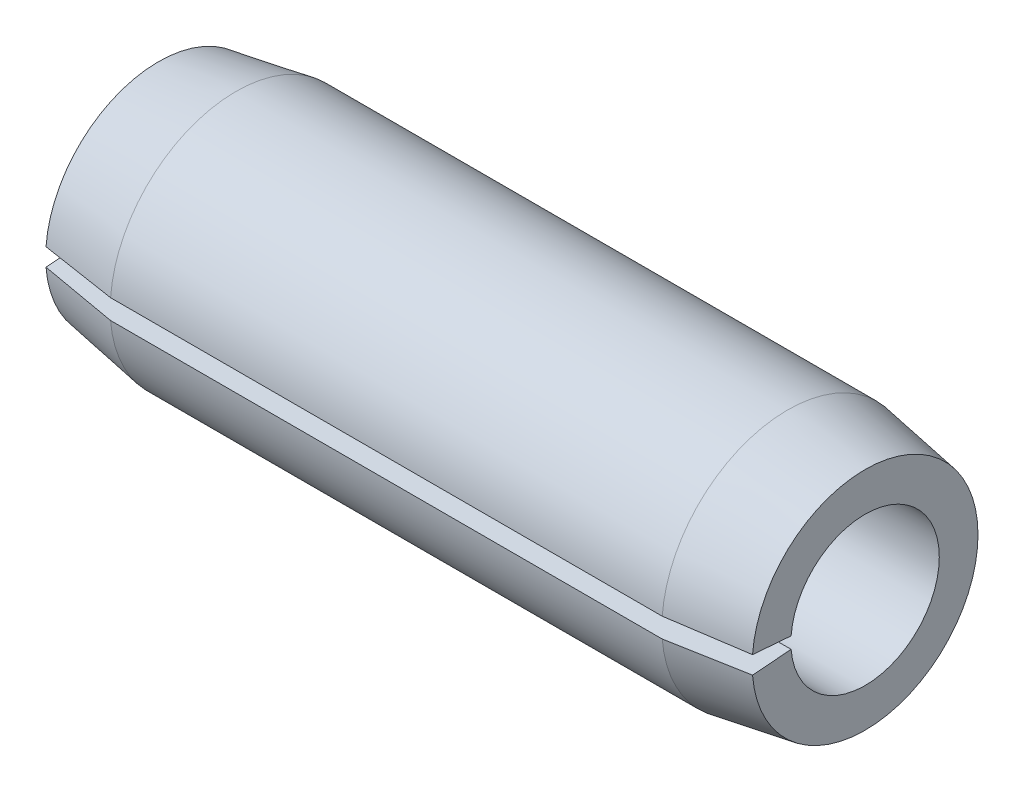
ISO-10303-21;
HEADER;
FILE_DESCRIPTION(('STEP AP214'),'2;1');
FILE_NAME('part.step','',(''),(''),'','','');
FILE_SCHEMA(('AUTOMOTIVE_DESIGN { 1 0 10303 214 1 1 1 1 }'));
ENDSEC;
DATA;
#1=APPLICATION_CONTEXT('core data for automotive mechanical design processes');
#2=APPLICATION_PROTOCOL_DEFINITION('international standard','automotive_design',2000,#1);
#3=PRODUCT_CONTEXT('',#1,'mechanical');
#4=PRODUCT('Part','Part','',(#3));
#5=PRODUCT_RELATED_PRODUCT_CATEGORY('part','',(#4));
#6=PRODUCT_DEFINITION_FORMATION('','',#4);
#7=PRODUCT_DEFINITION_CONTEXT('part definition',#1,'design');
#8=PRODUCT_DEFINITION('design','',#6,#7);
#9=PRODUCT_DEFINITION_SHAPE('','',#8);
#10=(LENGTH_UNIT() NAMED_UNIT(*) SI_UNIT(.MILLI.,.METRE.));
#11=(NAMED_UNIT(*) PLANE_ANGLE_UNIT() SI_UNIT($,.RADIAN.));
#12=(NAMED_UNIT(*) SI_UNIT($,.STERADIAN.) SOLID_ANGLE_UNIT());
#13=UNCERTAINTY_MEASURE_WITH_UNIT(LENGTH_MEASURE(1.E-05),#10,'distance_accuracy_value','');
#14=(GEOMETRIC_REPRESENTATION_CONTEXT(3) GLOBAL_UNCERTAINTY_ASSIGNED_CONTEXT((#13)) GLOBAL_UNIT_ASSIGNED_CONTEXT((#10,
#11,#12)) REPRESENTATION_CONTEXT('',''));
#15=CARTESIAN_POINT('',(0.,0.,0.));
#16=DIRECTION('',(0.,0.,1.));
#17=DIRECTION('',(1.,0.,0.));
#18=AXIS2_PLACEMENT_3D('',#15,#16,#17);
#19=CARTESIAN_POINT('',(0.,1.778,0.));
#20=DIRECTION('',(1.,0.,0.));
#21=DIRECTION('',(0.,0.,-1.));
#22=AXIS2_PLACEMENT_3D('',#19,#20,#21);
#23=PLANE('',#22);
#24=DIRECTION('',(0.,0.0784590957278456,0.996917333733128));
#25=VECTOR('',#24,1.);
#26=CARTESIAN_POINT('',(0.,0.,0.));
#27=LINE('',#26,#25);
#28=CARTESIAN_POINT('',(0.,0.0916716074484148,1.16479821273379));
#29=VERTEX_POINT('',#28);
#30=CARTESIAN_POINT('',(0.,0.139500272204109,1.7725190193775));
#31=VERTEX_POINT('',#30);
#32=EDGE_CURVE('E82',#29,#31,#27,.T.);
#33=ORIENTED_EDGE('',*,*,#32,.T.);
#34=CARTESIAN_POINT('',(0.,0.,0.));
#35=DIRECTION('',(-1.,0.,0.));
#36=DIRECTION('',(0.,0.,1.));
#37=AXIS2_PLACEMENT_3D('',#34,#35,#36);
#38=CIRCLE('',#37,1.778);
#39=CARTESIAN_POINT('',(0.,-0.13950027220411,1.7725190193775));
#40=VERTEX_POINT('',#39);
#41=EDGE_CURVE('E100',#31,#40,#38,.T.);
#42=ORIENTED_EDGE('',*,*,#41,.T.);
#43=DIRECTION('',(0.,-0.0784590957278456,0.996917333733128));
#44=VECTOR('',#43,1.);
#45=CARTESIAN_POINT('',(0.,0.,0.));
#46=LINE('',#45,#44);
#47=CARTESIAN_POINT('',(0.,-0.0916716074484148,1.16479821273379));
#48=VERTEX_POINT('',#47);
#49=EDGE_CURVE('E54',#48,#40,#46,.T.);
#50=ORIENTED_EDGE('',*,*,#49,.F.);
#51=CARTESIAN_POINT('',(0.,0.,0.));
#52=DIRECTION('',(-1.,0.,0.));
#53=DIRECTION('',(0.,0.,1.));
#54=AXIS2_PLACEMENT_3D('',#51,#52,#53);
#55=CIRCLE('',#54,1.1684);
#56=EDGE_CURVE('E97',#29,#48,#55,.T.);
#57=ORIENTED_EDGE('',*,*,#56,.F.);
#58=EDGE_LOOP('',(#33,#42,#50,#57));
#59=FACE_BOUND('',#58,.T.);
#60=ADVANCED_FACE('F33',(#59),#23,.F.);
#61=CARTESIAN_POINT('',(-9.52499999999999,0.,0.));
#62=DIRECTION('',(-1.,0.,0.));
#63=DIRECTION('',(0.,0.,1.));
#64=AXIS2_PLACEMENT_3D('',#61,#62,#63);
#65=CYLINDRICAL_SURFACE('',#64,1.1684);
#66=DIRECTION('',(-1.,0.,0.));
#67=VECTOR('',#66,1.);
#68=CARTESIAN_POINT('',(-9.52499999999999,0.0916716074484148,1.16479821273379));
#69=LINE('',#68,#67);
#70=CARTESIAN_POINT('',(11.1252,0.0916716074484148,1.16479821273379));
#71=VERTEX_POINT('',#70);
#72=EDGE_CURVE('E85',#29,#71,#69,.F.);
#73=ORIENTED_EDGE('',*,*,#72,.F.);
#74=ORIENTED_EDGE('',*,*,#56,.T.);
#75=DIRECTION('',(-1.,0.,0.));
#76=VECTOR('',#75,1.);
#77=CARTESIAN_POINT('',(-9.52499999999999,-0.0916716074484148,1.16479821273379));
#78=LINE('',#77,#76);
#79=CARTESIAN_POINT('',(11.1252,-0.0916716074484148,1.16479821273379));
#80=VERTEX_POINT('',#79);
#81=EDGE_CURVE('E118',#48,#80,#78,.F.);
#82=ORIENTED_EDGE('',*,*,#81,.T.);
#83=CARTESIAN_POINT('',(11.1252,0.,0.));
#84=DIRECTION('',(-1.,0.,0.));
#85=DIRECTION('',(0.,0.,1.));
#86=AXIS2_PLACEMENT_3D('',#83,#84,#85);
#87=CIRCLE('',#86,1.1684);
#88=EDGE_CURVE('E99',#71,#80,#87,.T.);
#89=ORIENTED_EDGE('',*,*,#88,.F.);
#90=EDGE_LOOP('',(#73,#74,#82,#89));
#91=FACE_BOUND('',#90,.T.);
#92=ADVANCED_FACE('F95',(#91),#65,.F.);
#93=CARTESIAN_POINT('',(11.1252,1.1684,0.));
#94=DIRECTION('',(-1.,0.,0.));
#95=DIRECTION('',(0.,0.,1.));
#96=AXIS2_PLACEMENT_3D('',#93,#94,#95);
#97=PLANE('',#96);
#98=DIRECTION('',(0.,0.0784590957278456,0.996917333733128));
#99=VECTOR('',#98,1.);
#100=CARTESIAN_POINT('',(11.1252,0.,0.));
#101=LINE('',#100,#99);
#102=CARTESIAN_POINT('',(11.1252,0.139500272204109,1.7725190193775));
#103=VERTEX_POINT('',#102);
#104=EDGE_CURVE('E127',#71,#103,#101,.T.);
#105=ORIENTED_EDGE('',*,*,#104,.F.);
#106=ORIENTED_EDGE('',*,*,#88,.T.);
#107=DIRECTION('',(0.,-0.0784590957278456,0.996917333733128));
#108=VECTOR('',#107,1.);
#109=CARTESIAN_POINT('',(11.1252,0.,0.));
#110=LINE('',#109,#108);
#111=CARTESIAN_POINT('',(11.1252,-0.139500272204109,1.7725190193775));
#112=VERTEX_POINT('',#111);
#113=EDGE_CURVE('E126',#80,#112,#110,.T.);
#114=ORIENTED_EDGE('',*,*,#113,.T.);
#115=CARTESIAN_POINT('',(11.1252,0.,0.));
#116=DIRECTION('',(-1.,0.,0.));
#117=DIRECTION('',(0.,0.,1.));
#118=AXIS2_PLACEMENT_3D('',#115,#116,#117);
#119=CIRCLE('',#118,1.778);
#120=EDGE_CURVE('E104',#103,#112,#119,.T.);
#121=ORIENTED_EDGE('',*,*,#120,.F.);
#122=EDGE_LOOP('',(#105,#106,#114,#121));
#123=FACE_BOUND('',#122,.T.);
#124=ADVANCED_FACE('F137',(#123),#97,.F.);
#125=CARTESIAN_POINT('',(11.1252,0.,0.));
#126=DIRECTION('',(-1.,0.,0.));
#127=DIRECTION('',(0.,0.,1.));
#128=AXIS2_PLACEMENT_3D('',#125,#126,#127);
#129=CONICAL_SURFACE('',#128,1.778,0.165148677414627);
#130=DIRECTION('',(-0.986393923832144,0.0128985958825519,0.163892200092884));
#131=VECTOR('',#130,1.);
#132=CARTESIAN_POINT('',(21.7932,0.,0.));
#133=LINE('',#132,#131);
#134=CARTESIAN_POINT('',(9.906,0.155443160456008,1.97509262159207));
#135=VERTEX_POINT('',#134);
#136=EDGE_CURVE('E101',#103,#135,#133,.T.);
#137=ORIENTED_EDGE('',*,*,#136,.F.);
#138=ORIENTED_EDGE('',*,*,#120,.T.);
#139=DIRECTION('',(-0.986393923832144,-0.0128985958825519,0.163892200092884));
#140=VECTOR('',#139,1.);
#141=CARTESIAN_POINT('',(21.7932,0.,0.));
#142=LINE('',#141,#140);
#143=CARTESIAN_POINT('',(9.906,-0.155443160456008,1.97509262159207));
#144=VERTEX_POINT('',#143);
#145=EDGE_CURVE('E120',#112,#144,#142,.T.);
#146=ORIENTED_EDGE('',*,*,#145,.T.);
#147=CARTESIAN_POINT('',(9.906,0.,0.));
#148=DIRECTION('',(-1.,0.,0.));
#149=DIRECTION('',(0.,0.,1.));
#150=AXIS2_PLACEMENT_3D('',#147,#148,#149);
#151=CIRCLE('',#150,1.9812);
#152=EDGE_CURVE('E109',#135,#144,#151,.T.);
#153=ORIENTED_EDGE('',*,*,#152,.F.);
#154=EDGE_LOOP('',(#137,#138,#146,#153));
#155=FACE_BOUND('',#154,.T.);
#156=ADVANCED_FACE('F136',(#155),#129,.T.);
#157=CARTESIAN_POINT('',(-9.52499999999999,0.,0.));
#158=DIRECTION('',(-1.,0.,0.));
#159=DIRECTION('',(0.,0.,1.));
#160=AXIS2_PLACEMENT_3D('',#157,#158,#159);
#161=CYLINDRICAL_SURFACE('',#160,1.9812);
#162=DIRECTION('',(-1.,0.,0.));
#163=VECTOR('',#162,1.);
#164=CARTESIAN_POINT('',(-9.52499999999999,0.155443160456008,1.97509262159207));
#165=LINE('',#164,#163);
#166=CARTESIAN_POINT('',(1.2192,0.155443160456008,1.97509262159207));
#167=VERTEX_POINT('',#166);
#168=EDGE_CURVE('E46',#135,#167,#165,.T.);
#169=ORIENTED_EDGE('',*,*,#168,.F.);
#170=ORIENTED_EDGE('',*,*,#152,.T.);
#171=DIRECTION('',(-1.,0.,0.));
#172=VECTOR('',#171,1.);
#173=CARTESIAN_POINT('',(-9.52499999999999,-0.155443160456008,1.97509262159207));
#174=LINE('',#173,#172);
#175=CARTESIAN_POINT('',(1.2192,-0.155443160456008,1.97509262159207));
#176=VERTEX_POINT('',#175);
#177=EDGE_CURVE('E123',#144,#176,#174,.T.);
#178=ORIENTED_EDGE('',*,*,#177,.T.);
#179=CARTESIAN_POINT('',(1.2192,0.,0.));
#180=DIRECTION('',(-1.,0.,0.));
#181=DIRECTION('',(0.,0.,1.));
#182=AXIS2_PLACEMENT_3D('',#179,#180,#181);
#183=CIRCLE('',#182,1.9812);
#184=EDGE_CURVE('E112',#167,#176,#183,.T.);
#185=ORIENTED_EDGE('',*,*,#184,.F.);
#186=EDGE_LOOP('',(#169,#170,#178,#185));
#187=FACE_BOUND('',#186,.T.);
#188=ADVANCED_FACE('F140',(#187),#161,.T.);
#189=CARTESIAN_POINT('',(1.2192,0.,0.));
#190=DIRECTION('',(1.,0.,0.));
#191=DIRECTION('',(0.,0.,-1.));
#192=AXIS2_PLACEMENT_3D('',#189,#190,#191);
#193=CONICAL_SURFACE('',#192,1.9812,0.165148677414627);
#194=DIRECTION('',(-0.986393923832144,-0.0128985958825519,-0.163892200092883));
#195=VECTOR('',#194,1.);
#196=CARTESIAN_POINT('',(-10.668,0.,0.));
#197=LINE('',#196,#195);
#198=EDGE_CURVE('E11',#167,#31,#197,.T.);
#199=ORIENTED_EDGE('',*,*,#198,.F.);
#200=ORIENTED_EDGE('',*,*,#184,.T.);
#201=DIRECTION('',(-0.986393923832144,0.0128985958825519,-0.163892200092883));
#202=VECTOR('',#201,1.);
#203=CARTESIAN_POINT('',(-10.668,0.,0.));
#204=LINE('',#203,#202);
#205=EDGE_CURVE('E40',#176,#40,#204,.T.);
#206=ORIENTED_EDGE('',*,*,#205,.T.);
#207=ORIENTED_EDGE('',*,*,#41,.F.);
#208=EDGE_LOOP('',(#199,#200,#206,#207));
#209=FACE_BOUND('',#208,.T.);
#210=ADVANCED_FACE('F143',(#209),#193,.T.);
#211=CARTESIAN_POINT('',(11.1252,0.,0.));
#212=DIRECTION('',(0.,-0.996917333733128,-0.0784590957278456));
#213=DIRECTION('',(0.,0.0784590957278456,-0.996917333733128));
#214=AXIS2_PLACEMENT_3D('',#211,#212,#213);
#215=PLANE('',#214);
#216=ORIENTED_EDGE('',*,*,#49,.T.);
#217=ORIENTED_EDGE('',*,*,#205,.F.);
#218=ORIENTED_EDGE('',*,*,#177,.F.);
#219=ORIENTED_EDGE('',*,*,#145,.F.);
#220=ORIENTED_EDGE('',*,*,#113,.F.);
#221=ORIENTED_EDGE('',*,*,#81,.F.);
#222=EDGE_LOOP('',(#216,#217,#218,#219,#220,#221));
#223=FACE_BOUND('',#222,.T.);
#224=ADVANCED_FACE('F138',(#223),#215,.F.);
#225=CARTESIAN_POINT('',(11.1252,0.,0.));
#226=DIRECTION('',(0.,-0.996917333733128,0.0784590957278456));
#227=DIRECTION('',(0.,-0.0784590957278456,-0.996917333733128));
#228=AXIS2_PLACEMENT_3D('',#225,#226,#227);
#229=PLANE('',#228);
#230=ORIENTED_EDGE('',*,*,#72,.T.);
#231=ORIENTED_EDGE('',*,*,#104,.T.);
#232=ORIENTED_EDGE('',*,*,#136,.T.);
#233=ORIENTED_EDGE('',*,*,#168,.T.);
#234=ORIENTED_EDGE('',*,*,#198,.T.);
#235=ORIENTED_EDGE('',*,*,#32,.F.);
#236=EDGE_LOOP('',(#230,#231,#232,#233,#234,#235));
#237=FACE_BOUND('',#236,.T.);
#238=ADVANCED_FACE('F84',(#237),#229,.T.);
#239=CLOSED_SHELL('',(#60,#92,#124,#156,#188,#210,#224,#238));
#240=MANIFOLD_SOLID_BREP('B2',#239);
#241=ADVANCED_BREP_SHAPE_REPRESENTATION('',(#18,#240),#14);
#242=SHAPE_DEFINITION_REPRESENTATION(#9,#241);
ENDSEC;
END-ISO-10303-21;
